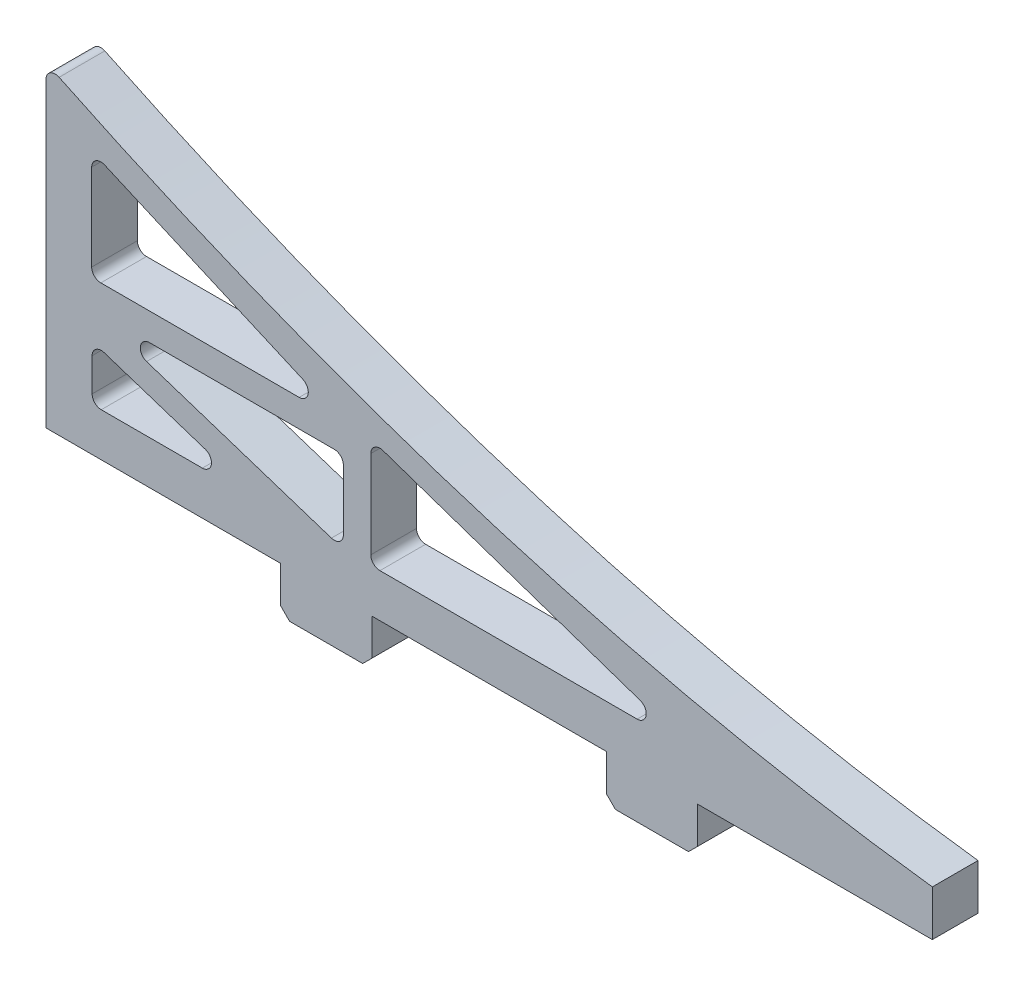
ISO-10303-21;
HEADER;
FILE_DESCRIPTION(('STEP AP214'),'2;1');
FILE_NAME('part.step','',(''),(''),'','','');
FILE_SCHEMA(('AUTOMOTIVE_DESIGN { 1 0 10303 214 1 1 1 1 }'));
ENDSEC;
DATA;
#1=APPLICATION_CONTEXT('core data for automotive mechanical design processes');
#2=APPLICATION_PROTOCOL_DEFINITION('international standard','automotive_design',2000,#1);
#3=PRODUCT_CONTEXT('',#1,'mechanical');
#4=PRODUCT('Part','Part','',(#3));
#5=PRODUCT_RELATED_PRODUCT_CATEGORY('part','',(#4));
#6=PRODUCT_DEFINITION_FORMATION('','',#4);
#7=PRODUCT_DEFINITION_CONTEXT('part definition',#1,'design');
#8=PRODUCT_DEFINITION('design','',#6,#7);
#9=PRODUCT_DEFINITION_SHAPE('','',#8);
#10=(LENGTH_UNIT() NAMED_UNIT(*) SI_UNIT(.MILLI.,.METRE.));
#11=(NAMED_UNIT(*) PLANE_ANGLE_UNIT() SI_UNIT($,.RADIAN.));
#12=(NAMED_UNIT(*) SI_UNIT($,.STERADIAN.) SOLID_ANGLE_UNIT());
#13=UNCERTAINTY_MEASURE_WITH_UNIT(LENGTH_MEASURE(1.E-05),#10,'distance_accuracy_value','');
#14=(GEOMETRIC_REPRESENTATION_CONTEXT(3) GLOBAL_UNCERTAINTY_ASSIGNED_CONTEXT((#13)) GLOBAL_UNIT_ASSIGNED_CONTEXT((#10,
#11,#12)) REPRESENTATION_CONTEXT('',''));
#15=CARTESIAN_POINT('',(0.,0.,0.));
#16=DIRECTION('',(0.,0.,1.));
#17=DIRECTION('',(1.,0.,0.));
#18=AXIS2_PLACEMENT_3D('',#15,#16,#17);
#19=CARTESIAN_POINT('',(-16.66,-2.95812499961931,5.));
#20=DIRECTION('',(0.,1.,0.));
#21=DIRECTION('',(-1.,0.,0.));
#22=AXIS2_PLACEMENT_3D('',#19,#20,#21);
#23=PLANE('',#22);
#24=DIRECTION('',(0.,0.,-1.));
#25=VECTOR('',#24,1.);
#26=CARTESIAN_POINT('',(-52.3399999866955,-2.95812499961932,5.));
#27=LINE('',#26,#25);
#28=CARTESIAN_POINT('',(-52.3399999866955,-2.95812499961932,5.));
#29=VERTEX_POINT('',#28);
#30=CARTESIAN_POINT('',(-52.3399999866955,-2.95812499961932,0.));
#31=VERTEX_POINT('',#30);
#32=EDGE_CURVE('E321',#29,#31,#27,.T.);
#33=ORIENTED_EDGE('',*,*,#32,.F.);
#34=DIRECTION('',(1.,0.,0.));
#35=VECTOR('',#34,1.);
#36=CARTESIAN_POINT('',(-16.66,-2.95812499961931,5.));
#37=LINE('',#36,#35);
#38=CARTESIAN_POINT('',(-77.9999999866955,-2.95812499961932,5.));
#39=VERTEX_POINT('',#38);
#40=EDGE_CURVE('E474',#39,#29,#37,.T.);
#41=ORIENTED_EDGE('',*,*,#40,.F.);
#42=DIRECTION('',(0.,0.,1.));
#43=VECTOR('',#42,1.);
#44=CARTESIAN_POINT('',(-77.9999999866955,-2.95812499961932,5.));
#45=LINE('',#44,#43);
#46=CARTESIAN_POINT('',(-77.9999999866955,-2.95812499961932,0.));
#47=VERTEX_POINT('',#46);
#48=EDGE_CURVE('E340',#47,#39,#45,.T.);
#49=ORIENTED_EDGE('',*,*,#48,.F.);
#50=DIRECTION('',(1.,0.,0.));
#51=VECTOR('',#50,1.);
#52=CARTESIAN_POINT('',(-16.66,-2.95812499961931,0.));
#53=LINE('',#52,#51);
#54=EDGE_CURVE('E313',#47,#31,#53,.T.);
#55=ORIENTED_EDGE('',*,*,#54,.T.);
#56=EDGE_LOOP('',(#33,#41,#49,#55));
#57=FACE_BOUND('',#56,.T.);
#58=ADVANCED_FACE('F35',(#57),#23,.F.);
#59=DIRECTION('',(0.,0.,1.));
#60=VECTOR('',#59,1.);
#61=CARTESIAN_POINT('',(-42.3399999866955,-2.95812499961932,5.));
#62=LINE('',#61,#60);
#63=CARTESIAN_POINT('',(-42.3399999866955,-2.95812499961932,0.));
#64=VERTEX_POINT('',#63);
#65=CARTESIAN_POINT('',(-42.3399999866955,-2.95812499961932,5.));
#66=VERTEX_POINT('',#65);
#67=EDGE_CURVE('E300',#64,#66,#62,.T.);
#68=ORIENTED_EDGE('',*,*,#67,.F.);
#69=CARTESIAN_POINT('',(-16.66,-2.95812499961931,0.));
#70=VERTEX_POINT('',#69);
#71=EDGE_CURVE('E306',#64,#70,#53,.T.);
#72=ORIENTED_EDGE('',*,*,#71,.T.);
#73=DIRECTION('',(0.,0.,-1.));
#74=VECTOR('',#73,1.);
#75=CARTESIAN_POINT('',(-16.66,-2.95812499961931,5.));
#76=LINE('',#75,#74);
#77=CARTESIAN_POINT('',(-16.66,-2.95812499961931,5.));
#78=VERTEX_POINT('',#77);
#79=EDGE_CURVE('E480',#78,#70,#76,.T.);
#80=ORIENTED_EDGE('',*,*,#79,.F.);
#81=EDGE_CURVE('E319',#66,#78,#37,.T.);
#82=ORIENTED_EDGE('',*,*,#81,.F.);
#83=EDGE_LOOP('',(#68,#72,#80,#82));
#84=FACE_BOUND('',#83,.T.);
#85=ADVANCED_FACE('F318',(#84),#23,.F.);
#86=DIRECTION('',(0.,0.,-1.));
#87=VECTOR('',#86,1.);
#88=CARTESIAN_POINT('',(-87.9999999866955,-2.95812499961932,5.));
#89=LINE('',#88,#87);
#90=CARTESIAN_POINT('',(-87.9999999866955,-2.95812499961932,5.));
#91=VERTEX_POINT('',#90);
#92=CARTESIAN_POINT('',(-87.9999999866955,-2.95812499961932,0.));
#93=VERTEX_POINT('',#92);
#94=EDGE_CURVE('E335',#91,#93,#89,.T.);
#95=ORIENTED_EDGE('',*,*,#94,.F.);
#96=CARTESIAN_POINT('',(-113.659999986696,-2.95812499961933,5.));
#97=VERTEX_POINT('',#96);
#98=EDGE_CURVE('E462',#97,#91,#37,.T.);
#99=ORIENTED_EDGE('',*,*,#98,.F.);
#100=DIRECTION('',(0.,0.,-1.));
#101=VECTOR('',#100,1.);
#102=CARTESIAN_POINT('',(-113.659999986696,-2.95812499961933,5.));
#103=LINE('',#102,#101);
#104=CARTESIAN_POINT('',(-113.659999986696,-2.95812499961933,0.));
#105=VERTEX_POINT('',#104);
#106=EDGE_CURVE('E482',#97,#105,#103,.T.);
#107=ORIENTED_EDGE('',*,*,#106,.T.);
#108=EDGE_CURVE('E316',#105,#93,#53,.T.);
#109=ORIENTED_EDGE('',*,*,#108,.T.);
#110=EDGE_LOOP('',(#95,#99,#107,#109));
#111=FACE_BOUND('',#110,.T.);
#112=ADVANCED_FACE('F373',(#111),#23,.F.);
#113=CARTESIAN_POINT('',(-16.6600000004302,2.04187500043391,5.));
#114=CARTESIAN_POINT('',(-65.1599999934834,8.04375000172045,5.));
#115=CARTESIAN_POINT('',(-113.659999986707,31.687499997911,5.));
#116=B_SPLINE_CURVE_WITH_KNOTS('',2,(#113,#114,#115),.UNSPECIFIED.,.F.,.F.,(3,3),
(0.0787227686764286,0.916247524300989),.UNSPECIFIED.);
#117=DIRECTION('',(0.,0.,-1.));
#118=VECTOR('',#117,1.);
#119=SURFACE_OF_LINEAR_EXTRUSION('',#116,#118);
#120=CARTESIAN_POINT('',(-16.6600000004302,2.04187500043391,0.));
#121=CARTESIAN_POINT('',(-65.1599999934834,8.04375000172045,0.));
#122=CARTESIAN_POINT('',(-113.659999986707,31.687499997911,0.));
#123=B_SPLINE_CURVE_WITH_KNOTS('',2,(#120,#121,#122),.UNSPECIFIED.,.F.,.F.,(3,3),
(0.0787227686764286,0.916247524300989),.UNSPECIFIED.);
#124=CARTESIAN_POINT('',(-16.66,2.04187500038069,0.));
#125=VERTEX_POINT('',#124);
#126=CARTESIAN_POINT('',(-112.225716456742,30.9921439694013,0.));
#127=VERTEX_POINT('',#126);
#128=EDGE_CURVE('E355',#125,#127,#123,.T.);
#129=ORIENTED_EDGE('',*,*,#128,.T.);
#130=DIRECTION('',(0.,0.,-1.));
#131=VECTOR('',#130,1.);
#132=CARTESIAN_POINT('',(-112.225716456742,30.9921439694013,0.));
#133=LINE('',#132,#131);
#134=CARTESIAN_POINT('',(-112.225716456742,30.9921439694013,5.));
#135=VERTEX_POINT('',#134);
#136=EDGE_CURVE('E490',#127,#135,#133,.F.);
#137=ORIENTED_EDGE('',*,*,#136,.T.);
#138=CARTESIAN_POINT('',(-16.66,2.04187500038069,5.));
#139=VERTEX_POINT('',#138);
#140=EDGE_CURVE('E356',#139,#135,#116,.T.);
#141=ORIENTED_EDGE('',*,*,#140,.F.);
#142=DIRECTION('',(0.,0.,-1.));
#143=VECTOR('',#142,1.);
#144=CARTESIAN_POINT('',(-16.66,2.04187500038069,5.));
#145=LINE('',#144,#143);
#146=EDGE_CURVE('E475',#139,#125,#145,.T.);
#147=ORIENTED_EDGE('',*,*,#146,.T.);
#148=EDGE_LOOP('',(#129,#137,#141,#147));
#149=FACE_BOUND('',#148,.T.);
#150=ADVANCED_FACE('F368',(#149),#119,.F.);
#151=CARTESIAN_POINT('',(-113.659999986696,31.6874999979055,5.));
#152=DIRECTION('',(1.,0.,0.));
#153=DIRECTION('',(0.,0.,-1.));
#154=AXIS2_PLACEMENT_3D('',#151,#152,#153);
#155=PLANE('',#154);
#156=DIRECTION('',(0.,-1.,0.));
#157=VECTOR('',#156,1.);
#158=CARTESIAN_POINT('',(-113.659999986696,31.6874999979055,5.));
#159=LINE('',#158,#157);
#160=CARTESIAN_POINT('',(-113.659999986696,30.0913677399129,5.));
#161=VERTEX_POINT('',#160);
#162=EDGE_CURVE('E362',#161,#97,#159,.T.);
#163=ORIENTED_EDGE('',*,*,#162,.F.);
#164=DIRECTION('',(0.,0.,-1.));
#165=VECTOR('',#164,1.);
#166=CARTESIAN_POINT('',(-113.659999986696,30.0913677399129,5.));
#167=LINE('',#166,#165);
#168=CARTESIAN_POINT('',(-113.659999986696,30.0913677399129,0.));
#169=VERTEX_POINT('',#168);
#170=EDGE_CURVE('E495',#161,#169,#167,.T.);
#171=ORIENTED_EDGE('',*,*,#170,.T.);
#172=DIRECTION('',(0.,-1.,0.));
#173=VECTOR('',#172,1.);
#174=CARTESIAN_POINT('',(-113.659999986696,31.6874999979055,0.));
#175=LINE('',#174,#173);
#176=EDGE_CURVE('E314',#169,#105,#175,.T.);
#177=ORIENTED_EDGE('',*,*,#176,.T.);
#178=ORIENTED_EDGE('',*,*,#106,.F.);
#179=EDGE_LOOP('',(#163,#171,#177,#178));
#180=FACE_BOUND('',#179,.T.);
#181=ADVANCED_FACE('F372',(#180),#155,.F.);
#182=CARTESIAN_POINT('',(-16.66,2.04187500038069,5.));
#183=DIRECTION('',(-1.,0.,0.));
#184=DIRECTION('',(0.,0.,1.));
#185=AXIS2_PLACEMENT_3D('',#182,#183,#184);
#186=PLANE('',#185);
#187=DIRECTION('',(0.,1.,0.));
#188=VECTOR('',#187,1.);
#189=CARTESIAN_POINT('',(-16.66,2.04187500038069,0.));
#190=LINE('',#189,#188);
#191=EDGE_CURVE('E309',#70,#125,#190,.T.);
#192=ORIENTED_EDGE('',*,*,#191,.T.);
#193=ORIENTED_EDGE('',*,*,#146,.F.);
#194=DIRECTION('',(0.,1.,0.));
#195=VECTOR('',#194,1.);
#196=CARTESIAN_POINT('',(-16.66,2.04187500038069,5.));
#197=LINE('',#196,#195);
#198=EDGE_CURVE('E473',#78,#139,#197,.T.);
#199=ORIENTED_EDGE('',*,*,#198,.F.);
#200=ORIENTED_EDGE('',*,*,#79,.T.);
#201=EDGE_LOOP('',(#192,#193,#199,#200));
#202=FACE_BOUND('',#201,.T.);
#203=ADVANCED_FACE('F484',(#202),#186,.F.);
#204=CARTESIAN_POINT('',(-65.159999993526,12.4542187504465,5.));
#205=DIRECTION('',(0.,0.,-1.));
#206=DIRECTION('',(-1.,0.,0.));
#207=AXIS2_PLACEMENT_3D('',#204,#205,#206);
#208=PLANE('',#207);
#209=DIRECTION('',(0.,-1.,0.));
#210=VECTOR('',#209,1.);
#211=CARTESIAN_POINT('',(-78.1128578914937,13.7911404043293,5.));
#212=LINE('',#211,#210);
#213=CARTESIAN_POINT('',(-78.1128578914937,12.3933814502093,5.));
#214=VERTEX_POINT('',#213);
#215=CARTESIAN_POINT('',(-78.1128578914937,2.79114040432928,5.));
#216=VERTEX_POINT('',#215);
#217=EDGE_CURVE('E667',#214,#216,#212,.T.);
#218=ORIENTED_EDGE('',*,*,#217,.F.);
#219=CARTESIAN_POINT('',(-77.1128578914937,12.3933814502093,5.));
#220=DIRECTION('',(0.,0.,-1.));
#221=DIRECTION('',(-1.,0.,0.));
#222=AXIS2_PLACEMENT_3D('',#219,#220,#221);
#223=CIRCLE('',#222,1.);
#224=CARTESIAN_POINT('',(-76.7899678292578,13.3398179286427,5.));
#225=VERTEX_POINT('',#224);
#226=EDGE_CURVE('E583',#214,#225,#223,.T.);
#227=ORIENTED_EDGE('',*,*,#226,.T.);
#228=DIRECTION('',(-0.946436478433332,0.322890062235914,0.));
#229=VECTOR('',#228,1.);
#230=CARTESIAN_POINT('',(-42.939159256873,1.79114040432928,5.));
#231=LINE('',#230,#229);
#232=CARTESIAN_POINT('',(-48.6444400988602,3.73757688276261,5.));
#233=VERTEX_POINT('',#232);
#234=EDGE_CURVE('E670',#233,#225,#231,.T.);
#235=ORIENTED_EDGE('',*,*,#234,.F.);
#236=CARTESIAN_POINT('',(-48.9673301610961,2.79114040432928,5.));
#237=DIRECTION('',(0.,0.,-1.));
#238=DIRECTION('',(-1.,0.,0.));
#239=AXIS2_PLACEMENT_3D('',#236,#237,#238);
#240=CIRCLE('',#239,1.);
#241=CARTESIAN_POINT('',(-48.9673301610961,1.79114040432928,5.));
#242=VERTEX_POINT('',#241);
#243=EDGE_CURVE('E575',#233,#242,#240,.T.);
#244=ORIENTED_EDGE('',*,*,#243,.T.);
#245=DIRECTION('',(1.,0.,0.));
#246=VECTOR('',#245,1.);
#247=CARTESIAN_POINT('',(-78.1128578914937,1.79114040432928,5.));
#248=LINE('',#247,#246);
#249=CARTESIAN_POINT('',(-77.1128578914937,1.79114040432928,5.));
#250=VERTEX_POINT('',#249);
#251=EDGE_CURVE('E663',#250,#242,#248,.T.);
#252=ORIENTED_EDGE('',*,*,#251,.F.);
#253=CARTESIAN_POINT('',(-77.1128578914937,2.79114040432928,5.));
#254=DIRECTION('',(0.,0.,-1.));
#255=DIRECTION('',(-1.,0.,0.));
#256=AXIS2_PLACEMENT_3D('',#253,#254,#255);
#257=CIRCLE('',#256,1.);
#258=EDGE_CURVE('E579',#250,#216,#257,.T.);
#259=ORIENTED_EDGE('',*,*,#258,.T.);
#260=EDGE_LOOP('',(#218,#227,#235,#244,#252,#259));
#261=FACE_BOUND('',#260,.T.);
#262=DIRECTION('',(0.,1.,0.));
#263=VECTOR('',#262,1.);
#264=CARTESIAN_POINT('',(-81.1128578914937,10.7911404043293,5.));
#265=LINE('',#264,#263);
#266=CARTESIAN_POINT('',(-81.1128578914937,3.17060486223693,5.));
#267=VERTEX_POINT('',#266);
#268=CARTESIAN_POINT('',(-81.1128578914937,9.79114040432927,5.));
#269=VERTEX_POINT('',#268);
#270=EDGE_CURVE('E686',#267,#269,#265,.T.);
#271=ORIENTED_EDGE('',*,*,#270,.F.);
#272=CARTESIAN_POINT('',(-82.1128578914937,3.17060486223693,5.));
#273=DIRECTION('',(0.,0.,-1.));
#274=DIRECTION('',(-1.,0.,0.));
#275=AXIS2_PLACEMENT_3D('',#272,#273,#274);
#276=CIRCLE('',#275,1.);
#277=CARTESIAN_POINT('',(-82.4238969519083,2.22020773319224,5.));
#278=VERTEX_POINT('',#277);
#279=EDGE_CURVE('E591',#267,#278,#276,.T.);
#280=ORIENTED_EDGE('',*,*,#279,.T.);
#281=DIRECTION('',(0.950397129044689,-0.311039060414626,0.));
#282=VECTOR('',#281,1.);
#283=CARTESIAN_POINT('',(-81.1128578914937,1.79114040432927,5.));
#284=LINE('',#283,#282);
#285=CARTESIAN_POINT('',(-102.653311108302,8.84074327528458,5.));
#286=VERTEX_POINT('',#285);
#287=EDGE_CURVE('E689',#286,#278,#284,.T.);
#288=ORIENTED_EDGE('',*,*,#287,.F.);
#289=CARTESIAN_POINT('',(-102.342272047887,9.79114040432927,5.));
#290=DIRECTION('',(0.,0.,-1.));
#291=DIRECTION('',(-1.,0.,0.));
#292=AXIS2_PLACEMENT_3D('',#289,#290,#291);
#293=CIRCLE('',#292,1.);
#294=CARTESIAN_POINT('',(-102.342272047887,10.7911404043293,5.));
#295=VERTEX_POINT('',#294);
#296=EDGE_CURVE('E595',#286,#295,#293,.T.);
#297=ORIENTED_EDGE('',*,*,#296,.T.);
#298=DIRECTION('',(-1.,0.,0.));
#299=VECTOR('',#298,1.);
#300=CARTESIAN_POINT('',(-108.612857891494,10.7911404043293,5.));
#301=LINE('',#300,#299);
#302=CARTESIAN_POINT('',(-82.1128578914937,10.7911404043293,5.));
#303=VERTEX_POINT('',#302);
#304=EDGE_CURVE('E682',#303,#295,#301,.T.);
#305=ORIENTED_EDGE('',*,*,#304,.F.);
#306=CARTESIAN_POINT('',(-82.1128578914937,9.79114040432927,5.));
#307=DIRECTION('',(0.,0.,-1.));
#308=DIRECTION('',(-1.,0.,0.));
#309=AXIS2_PLACEMENT_3D('',#306,#307,#308);
#310=CIRCLE('',#309,1.);
#311=EDGE_CURVE('E587',#303,#269,#310,.T.);
#312=ORIENTED_EDGE('',*,*,#311,.T.);
#313=EDGE_LOOP('',(#271,#280,#288,#297,#305,#312));
#314=FACE_BOUND('',#313,.T.);
#315=DIRECTION('',(0.,-1.,0.));
#316=VECTOR('',#315,1.);
#317=CARTESIAN_POINT('',(-108.612857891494,7.79114040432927,5.));
#318=LINE('',#317,#316);
#319=CARTESIAN_POINT('',(-108.612857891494,6.41167594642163,5.));
#320=VERTEX_POINT('',#319);
#321=CARTESIAN_POINT('',(-108.612857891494,2.79114040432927,5.));
#322=VERTEX_POINT('',#321);
#323=EDGE_CURVE('E704',#320,#322,#318,.T.);
#324=ORIENTED_EDGE('',*,*,#323,.F.);
#325=CARTESIAN_POINT('',(-107.612857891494,6.41167594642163,5.));
#326=DIRECTION('',(0.,0.,-1.));
#327=DIRECTION('',(-1.,0.,0.));
#328=AXIS2_PLACEMENT_3D('',#325,#326,#327);
#329=CIRCLE('',#328,1.);
#330=CARTESIAN_POINT('',(-107.301818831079,7.36207307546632,5.));
#331=VERTEX_POINT('',#330);
#332=EDGE_CURVE('E599',#320,#331,#329,.T.);
#333=ORIENTED_EDGE('',*,*,#332,.T.);
#334=DIRECTION('',(-0.950397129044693,0.311039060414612,0.));
#335=VECTOR('',#334,1.);
#336=CARTESIAN_POINT('',(-90.2795245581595,1.79114040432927,5.));
#337=LINE('',#336,#335);
#338=CARTESIAN_POINT('',(-96.2390713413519,3.74153753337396,5.));
#339=VERTEX_POINT('',#338);
#340=EDGE_CURVE('E676',#339,#331,#337,.T.);
#341=ORIENTED_EDGE('',*,*,#340,.F.);
#342=CARTESIAN_POINT('',(-96.5501104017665,2.79114040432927,5.));
#343=DIRECTION('',(0.,0.,-1.));
#344=DIRECTION('',(-1.,0.,0.));
#345=AXIS2_PLACEMENT_3D('',#342,#343,#344);
#346=CIRCLE('',#345,1.);
#347=CARTESIAN_POINT('',(-96.5501104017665,1.79114040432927,5.));
#348=VERTEX_POINT('',#347);
#349=EDGE_CURVE('E607',#339,#348,#346,.T.);
#350=ORIENTED_EDGE('',*,*,#349,.T.);
#351=DIRECTION('',(1.,0.,0.));
#352=VECTOR('',#351,1.);
#353=CARTESIAN_POINT('',(-108.612857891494,1.79114040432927,5.));
#354=LINE('',#353,#352);
#355=CARTESIAN_POINT('',(-107.612857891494,1.79114040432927,5.));
#356=VERTEX_POINT('',#355);
#357=EDGE_CURVE('E700',#356,#348,#354,.T.);
#358=ORIENTED_EDGE('',*,*,#357,.F.);
#359=CARTESIAN_POINT('',(-107.612857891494,2.79114040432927,5.));
#360=DIRECTION('',(0.,0.,-1.));
#361=DIRECTION('',(-1.,0.,0.));
#362=AXIS2_PLACEMENT_3D('',#359,#360,#361);
#363=CIRCLE('',#362,1.);
#364=EDGE_CURVE('E603',#356,#322,#363,.T.);
#365=ORIENTED_EDGE('',*,*,#364,.T.);
#366=EDGE_LOOP('',(#324,#333,#341,#350,#358,#365));
#367=FACE_BOUND('',#366,.T.);
#368=DIRECTION('',(0.,-1.,0.));
#369=VECTOR('',#368,1.);
#370=CARTESIAN_POINT('',(-108.659999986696,25.7911404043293,5.));
#371=LINE('',#370,#369);
#372=CARTESIAN_POINT('',(-108.659999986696,24.2636151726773,5.));
#373=VERTEX_POINT('',#372);
#374=CARTESIAN_POINT('',(-108.659999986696,14.7911404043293,5.));
#375=VERTEX_POINT('',#374);
#376=EDGE_CURVE('E650',#373,#375,#371,.T.);
#377=ORIENTED_EDGE('',*,*,#376,.F.);
#378=CARTESIAN_POINT('',(-107.659999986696,24.2636151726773,5.));
#379=DIRECTION('',(0.,0.,-1.));
#380=DIRECTION('',(-1.,0.,0.));
#381=AXIS2_PLACEMENT_3D('',#378,#379,#380);
#382=CIRCLE('',#381,1.);
#383=CARTESIAN_POINT('',(-107.259999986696,25.1801303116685,5.));
#384=VERTEX_POINT('',#383);
#385=EDGE_CURVE('E526',#373,#384,#382,.T.);
#386=ORIENTED_EDGE('',*,*,#385,.T.);
#387=DIRECTION('',(-0.916515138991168,0.4,0.));
#388=VECTOR('',#387,1.);
#389=CARTESIAN_POINT('',(-81.1645458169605,13.7911404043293,5.));
#390=LINE('',#389,#388);
#391=CARTESIAN_POINT('',(-85.5558336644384,15.7076555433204,5.));
#392=VERTEX_POINT('',#391);
#393=EDGE_CURVE('E653',#392,#384,#390,.T.);
#394=ORIENTED_EDGE('',*,*,#393,.F.);
#395=CARTESIAN_POINT('',(-85.9558336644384,14.7911404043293,5.));
#396=DIRECTION('',(0.,0.,-1.));
#397=DIRECTION('',(-1.,0.,0.));
#398=AXIS2_PLACEMENT_3D('',#395,#396,#397);
#399=CIRCLE('',#398,1.);
#400=CARTESIAN_POINT('',(-85.9558336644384,13.7911404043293,5.));
#401=VERTEX_POINT('',#400);
#402=EDGE_CURVE('E507',#392,#401,#399,.T.);
#403=ORIENTED_EDGE('',*,*,#402,.T.);
#404=DIRECTION('',(1.,0.,0.));
#405=VECTOR('',#404,1.);
#406=CARTESIAN_POINT('',(-108.659999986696,13.7911404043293,5.));
#407=LINE('',#406,#405);
#408=CARTESIAN_POINT('',(-107.659999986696,13.7911404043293,5.));
#409=VERTEX_POINT('',#408);
#410=EDGE_CURVE('E647',#409,#401,#407,.T.);
#411=ORIENTED_EDGE('',*,*,#410,.F.);
#412=CARTESIAN_POINT('',(-107.659999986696,14.7911404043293,5.));
#413=DIRECTION('',(0.,0.,-1.));
#414=DIRECTION('',(-1.,0.,0.));
#415=AXIS2_PLACEMENT_3D('',#412,#413,#414);
#416=CIRCLE('',#415,1.);
#417=EDGE_CURVE('E522',#409,#375,#416,.T.);
#418=ORIENTED_EDGE('',*,*,#417,.T.);
#419=EDGE_LOOP('',(#377,#386,#394,#403,#411,#418));
#420=FACE_BOUND('',#419,.T.);
#421=DIRECTION('',(-1.,0.,0.));
#422=VECTOR('',#421,1.);
#423=CARTESIAN_POINT('',(-52.3399999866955,-7.95812499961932,5.));
#424=LINE('',#423,#422);
#425=CARTESIAN_POINT('',(-43.3399999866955,-7.95812499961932,5.));
#426=VERTEX_POINT('',#425);
#427=CARTESIAN_POINT('',(-51.3399999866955,-7.95812499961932,5.));
#428=VERTEX_POINT('',#427);
#429=EDGE_CURVE('E324',#426,#428,#424,.T.);
#430=ORIENTED_EDGE('',*,*,#429,.F.);
#431=DIRECTION('',(0.70710678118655,0.707106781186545,0.));
#432=VECTOR('',#431,1.);
#433=CARTESIAN_POINT('',(-43.3399999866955,-7.95812499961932,5.));
#434=LINE('',#433,#432);
#435=CARTESIAN_POINT('',(-42.3399999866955,-6.9581249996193,5.));
#436=VERTEX_POINT('',#435);
#437=EDGE_CURVE('E637',#426,#436,#434,.T.);
#438=ORIENTED_EDGE('',*,*,#437,.T.);
#439=DIRECTION('',(0.,1.,0.));
#440=VECTOR('',#439,1.);
#441=CARTESIAN_POINT('',(-42.3399999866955,-7.95812499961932,5.));
#442=LINE('',#441,#440);
#443=EDGE_CURVE('E303',#436,#66,#442,.T.);
#444=ORIENTED_EDGE('',*,*,#443,.T.);
#445=ORIENTED_EDGE('',*,*,#81,.T.);
#446=ORIENTED_EDGE('',*,*,#198,.T.);
#447=ORIENTED_EDGE('',*,*,#140,.T.);
#448=CARTESIAN_POINT('',(-112.659999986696,30.0913677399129,5.));
#449=DIRECTION('',(0.,0.,-1.));
#450=DIRECTION('',(-1.,0.,0.));
#451=AXIS2_PLACEMENT_3D('',#448,#449,#450);
#452=CIRCLE('',#451,1.);
#453=EDGE_CURVE('E492',#135,#161,#452,.F.);
#454=ORIENTED_EDGE('',*,*,#453,.T.);
#455=ORIENTED_EDGE('',*,*,#162,.T.);
#456=ORIENTED_EDGE('',*,*,#98,.T.);
#457=DIRECTION('',(0.,1.,0.));
#458=VECTOR('',#457,1.);
#459=CARTESIAN_POINT('',(-87.9999999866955,-7.95812499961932,5.));
#460=LINE('',#459,#458);
#461=CARTESIAN_POINT('',(-87.9999999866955,-6.95812499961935,5.));
#462=VERTEX_POINT('',#461);
#463=EDGE_CURVE('E343',#462,#91,#460,.T.);
#464=ORIENTED_EDGE('',*,*,#463,.F.);
#465=DIRECTION('',(0.707106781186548,-0.707106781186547,0.));
#466=VECTOR('',#465,1.);
#467=CARTESIAN_POINT('',(-86.9999999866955,-7.95812499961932,5.));
#468=LINE('',#467,#466);
#469=CARTESIAN_POINT('',(-86.9999999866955,-7.95812499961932,5.));
#470=VERTEX_POINT('',#469);
#471=EDGE_CURVE('E617',#462,#470,#468,.T.);
#472=ORIENTED_EDGE('',*,*,#471,.T.);
#473=DIRECTION('',(-1.,0.,0.));
#474=VECTOR('',#473,1.);
#475=CARTESIAN_POINT('',(-87.9999999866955,-7.95812499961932,5.));
#476=LINE('',#475,#474);
#477=CARTESIAN_POINT('',(-78.9999999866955,-7.95812499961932,5.));
#478=VERTEX_POINT('',#477);
#479=EDGE_CURVE('E339',#478,#470,#476,.T.);
#480=ORIENTED_EDGE('',*,*,#479,.F.);
#481=DIRECTION('',(0.707106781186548,0.707106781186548,0.));
#482=VECTOR('',#481,1.);
#483=CARTESIAN_POINT('',(-78.9999999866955,-7.95812499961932,5.));
#484=LINE('',#483,#482);
#485=CARTESIAN_POINT('',(-77.9999999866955,-6.95812499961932,5.));
#486=VERTEX_POINT('',#485);
#487=EDGE_CURVE('E619',#478,#486,#484,.T.);
#488=ORIENTED_EDGE('',*,*,#487,.T.);
#489=DIRECTION('',(0.,1.,0.));
#490=VECTOR('',#489,1.);
#491=CARTESIAN_POINT('',(-77.9999999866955,-7.95812499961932,5.));
#492=LINE('',#491,#490);
#493=EDGE_CURVE('E349',#486,#39,#492,.T.);
#494=ORIENTED_EDGE('',*,*,#493,.T.);
#495=ORIENTED_EDGE('',*,*,#40,.T.);
#496=DIRECTION('',(0.,1.,0.));
#497=VECTOR('',#496,1.);
#498=CARTESIAN_POINT('',(-52.3399999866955,-7.95812499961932,5.));
#499=LINE('',#498,#497);
#500=CARTESIAN_POINT('',(-52.3399999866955,-6.9581249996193,5.));
#501=VERTEX_POINT('',#500);
#502=EDGE_CURVE('E331',#501,#29,#499,.T.);
#503=ORIENTED_EDGE('',*,*,#502,.F.);
#504=DIRECTION('',(0.707106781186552,-0.707106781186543,0.));
#505=VECTOR('',#504,1.);
#506=CARTESIAN_POINT('',(-51.3399999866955,-7.95812499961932,5.));
#507=LINE('',#506,#505);
#508=EDGE_CURVE('E635',#501,#428,#507,.T.);
#509=ORIENTED_EDGE('',*,*,#508,.T.);
#510=EDGE_LOOP('',(#430,#438,#444,#445,#446,#447,#454,#455,#456,#464,#472,#480,#488,#494,#495,
#503,#509));
#511=FACE_BOUND('',#510,.T.);
#512=ADVANCED_FACE('F469',(#261,#314,#367,#420,#511),#208,.F.);
#513=CARTESIAN_POINT('',(-65.159999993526,12.4542187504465,0.));
#514=DIRECTION('',(0.,0.,-1.));
#515=DIRECTION('',(-1.,0.,0.));
#516=AXIS2_PLACEMENT_3D('',#513,#514,#515);
#517=PLANE('',#516);
#518=DIRECTION('',(1.,0.,0.));
#519=VECTOR('',#518,1.);
#520=CARTESIAN_POINT('',(-78.1128578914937,1.79114040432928,0.));
#521=LINE('',#520,#519);
#522=CARTESIAN_POINT('',(-77.1128578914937,1.79114040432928,0.));
#523=VERTEX_POINT('',#522);
#524=CARTESIAN_POINT('',(-48.9673301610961,1.79114040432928,0.));
#525=VERTEX_POINT('',#524);
#526=EDGE_CURVE('E673',#523,#525,#521,.T.);
#527=ORIENTED_EDGE('',*,*,#526,.T.);
#528=CARTESIAN_POINT('',(-48.9673301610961,2.79114040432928,0.));
#529=DIRECTION('',(0.,0.,-1.));
#530=DIRECTION('',(-1.,0.,0.));
#531=AXIS2_PLACEMENT_3D('',#528,#529,#530);
#532=CIRCLE('',#531,1.);
#533=CARTESIAN_POINT('',(-48.6444400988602,3.73757688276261,0.));
#534=VERTEX_POINT('',#533);
#535=EDGE_CURVE('E577',#525,#534,#532,.F.);
#536=ORIENTED_EDGE('',*,*,#535,.T.);
#537=DIRECTION('',(-0.946436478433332,0.322890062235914,0.));
#538=VECTOR('',#537,1.);
#539=CARTESIAN_POINT('',(-42.939159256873,1.79114040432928,0.));
#540=LINE('',#539,#538);
#541=CARTESIAN_POINT('',(-76.7899678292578,13.3398179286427,0.));
#542=VERTEX_POINT('',#541);
#543=EDGE_CURVE('E666',#534,#542,#540,.T.);
#544=ORIENTED_EDGE('',*,*,#543,.T.);
#545=CARTESIAN_POINT('',(-77.1128578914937,12.3933814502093,0.));
#546=DIRECTION('',(0.,0.,-1.));
#547=DIRECTION('',(-1.,0.,0.));
#548=AXIS2_PLACEMENT_3D('',#545,#546,#547);
#549=CIRCLE('',#548,1.);
#550=CARTESIAN_POINT('',(-78.1128578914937,12.3933814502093,0.));
#551=VERTEX_POINT('',#550);
#552=EDGE_CURVE('E585',#542,#551,#549,.F.);
#553=ORIENTED_EDGE('',*,*,#552,.T.);
#554=DIRECTION('',(0.,-1.,0.));
#555=VECTOR('',#554,1.);
#556=CARTESIAN_POINT('',(-78.1128578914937,13.7911404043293,0.));
#557=LINE('',#556,#555);
#558=CARTESIAN_POINT('',(-78.1128578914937,2.79114040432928,0.));
#559=VERTEX_POINT('',#558);
#560=EDGE_CURVE('E677',#551,#559,#557,.T.);
#561=ORIENTED_EDGE('',*,*,#560,.T.);
#562=CARTESIAN_POINT('',(-77.1128578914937,2.79114040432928,0.));
#563=DIRECTION('',(0.,0.,-1.));
#564=DIRECTION('',(-1.,0.,0.));
#565=AXIS2_PLACEMENT_3D('',#562,#563,#564);
#566=CIRCLE('',#565,1.);
#567=EDGE_CURVE('E581',#559,#523,#566,.F.);
#568=ORIENTED_EDGE('',*,*,#567,.T.);
#569=EDGE_LOOP('',(#527,#536,#544,#553,#561,#568));
#570=FACE_BOUND('',#569,.T.);
#571=DIRECTION('',(-1.,0.,0.));
#572=VECTOR('',#571,1.);
#573=CARTESIAN_POINT('',(-108.612857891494,10.7911404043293,0.));
#574=LINE('',#573,#572);
#575=CARTESIAN_POINT('',(-82.1128578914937,10.7911404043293,0.));
#576=VERTEX_POINT('',#575);
#577=CARTESIAN_POINT('',(-102.342272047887,10.7911404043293,0.));
#578=VERTEX_POINT('',#577);
#579=EDGE_CURVE('E656',#576,#578,#574,.T.);
#580=ORIENTED_EDGE('',*,*,#579,.T.);
#581=CARTESIAN_POINT('',(-102.342272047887,9.79114040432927,0.));
#582=DIRECTION('',(0.,0.,-1.));
#583=DIRECTION('',(-1.,0.,0.));
#584=AXIS2_PLACEMENT_3D('',#581,#582,#583);
#585=CIRCLE('',#584,1.);
#586=CARTESIAN_POINT('',(-102.653311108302,8.84074327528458,0.));
#587=VERTEX_POINT('',#586);
#588=EDGE_CURVE('E597',#578,#587,#585,.F.);
#589=ORIENTED_EDGE('',*,*,#588,.T.);
#590=DIRECTION('',(0.950397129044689,-0.311039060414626,0.));
#591=VECTOR('',#590,1.);
#592=CARTESIAN_POINT('',(-81.1128578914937,1.79114040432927,0.));
#593=LINE('',#592,#591);
#594=CARTESIAN_POINT('',(-82.4238969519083,2.22020773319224,0.));
#595=VERTEX_POINT('',#594);
#596=EDGE_CURVE('E685',#587,#595,#593,.T.);
#597=ORIENTED_EDGE('',*,*,#596,.T.);
#598=CARTESIAN_POINT('',(-82.1128578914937,3.17060486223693,0.));
#599=DIRECTION('',(0.,0.,-1.));
#600=DIRECTION('',(-1.,0.,0.));
#601=AXIS2_PLACEMENT_3D('',#598,#599,#600);
#602=CIRCLE('',#601,1.);
#603=CARTESIAN_POINT('',(-81.1128578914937,3.17060486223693,0.));
#604=VERTEX_POINT('',#603);
#605=EDGE_CURVE('E593',#595,#604,#602,.F.);
#606=ORIENTED_EDGE('',*,*,#605,.T.);
#607=DIRECTION('',(0.,1.,0.));
#608=VECTOR('',#607,1.);
#609=CARTESIAN_POINT('',(-81.1128578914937,10.7911404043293,0.));
#610=LINE('',#609,#608);
#611=CARTESIAN_POINT('',(-81.1128578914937,9.79114040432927,0.));
#612=VERTEX_POINT('',#611);
#613=EDGE_CURVE('E695',#604,#612,#610,.T.);
#614=ORIENTED_EDGE('',*,*,#613,.T.);
#615=CARTESIAN_POINT('',(-82.1128578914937,9.79114040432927,0.));
#616=DIRECTION('',(0.,0.,-1.));
#617=DIRECTION('',(-1.,0.,0.));
#618=AXIS2_PLACEMENT_3D('',#615,#616,#617);
#619=CIRCLE('',#618,1.);
#620=EDGE_CURVE('E589',#612,#576,#619,.F.);
#621=ORIENTED_EDGE('',*,*,#620,.T.);
#622=EDGE_LOOP('',(#580,#589,#597,#606,#614,#621));
#623=FACE_BOUND('',#622,.T.);
#624=DIRECTION('',(1.,0.,0.));
#625=VECTOR('',#624,1.);
#626=CARTESIAN_POINT('',(-108.612857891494,1.79114040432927,0.));
#627=LINE('',#626,#625);
#628=CARTESIAN_POINT('',(-107.612857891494,1.79114040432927,0.));
#629=VERTEX_POINT('',#628);
#630=CARTESIAN_POINT('',(-96.5501104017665,1.79114040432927,0.));
#631=VERTEX_POINT('',#630);
#632=EDGE_CURVE('E692',#629,#631,#627,.T.);
#633=ORIENTED_EDGE('',*,*,#632,.T.);
#634=CARTESIAN_POINT('',(-96.5501104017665,2.79114040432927,0.));
#635=DIRECTION('',(0.,0.,-1.));
#636=DIRECTION('',(-1.,0.,0.));
#637=AXIS2_PLACEMENT_3D('',#634,#635,#636);
#638=CIRCLE('',#637,1.);
#639=CARTESIAN_POINT('',(-96.2390713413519,3.74153753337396,0.));
#640=VERTEX_POINT('',#639);
#641=EDGE_CURVE('E609',#631,#640,#638,.F.);
#642=ORIENTED_EDGE('',*,*,#641,.T.);
#643=DIRECTION('',(-0.950397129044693,0.311039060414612,0.));
#644=VECTOR('',#643,1.);
#645=CARTESIAN_POINT('',(-90.2795245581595,1.79114040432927,0.));
#646=LINE('',#645,#644);
#647=CARTESIAN_POINT('',(-107.301818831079,7.36207307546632,0.));
#648=VERTEX_POINT('',#647);
#649=EDGE_CURVE('E703',#640,#648,#646,.T.);
#650=ORIENTED_EDGE('',*,*,#649,.T.);
#651=CARTESIAN_POINT('',(-107.612857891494,6.41167594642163,0.));
#652=DIRECTION('',(0.,0.,-1.));
#653=DIRECTION('',(-1.,0.,0.));
#654=AXIS2_PLACEMENT_3D('',#651,#652,#653);
#655=CIRCLE('',#654,1.);
#656=CARTESIAN_POINT('',(-108.612857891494,6.41167594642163,0.));
#657=VERTEX_POINT('',#656);
#658=EDGE_CURVE('E601',#648,#657,#655,.F.);
#659=ORIENTED_EDGE('',*,*,#658,.T.);
#660=DIRECTION('',(0.,-1.,0.));
#661=VECTOR('',#660,1.);
#662=CARTESIAN_POINT('',(-108.612857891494,7.79114040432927,0.));
#663=LINE('',#662,#661);
#664=CARTESIAN_POINT('',(-108.612857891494,2.79114040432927,0.));
#665=VERTEX_POINT('',#664);
#666=EDGE_CURVE('E711',#657,#665,#663,.T.);
#667=ORIENTED_EDGE('',*,*,#666,.T.);
#668=CARTESIAN_POINT('',(-107.612857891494,2.79114040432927,0.));
#669=DIRECTION('',(0.,0.,-1.));
#670=DIRECTION('',(-1.,0.,0.));
#671=AXIS2_PLACEMENT_3D('',#668,#669,#670);
#672=CIRCLE('',#671,1.);
#673=EDGE_CURVE('E605',#665,#629,#672,.F.);
#674=ORIENTED_EDGE('',*,*,#673,.T.);
#675=EDGE_LOOP('',(#633,#642,#650,#659,#667,#674));
#676=FACE_BOUND('',#675,.T.);
#677=DIRECTION('',(0.,-1.,0.));
#678=VECTOR('',#677,1.);
#679=CARTESIAN_POINT('',(-108.659999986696,25.7911404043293,0.));
#680=LINE('',#679,#678);
#681=CARTESIAN_POINT('',(-108.659999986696,24.2636151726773,0.));
#682=VERTEX_POINT('',#681);
#683=CARTESIAN_POINT('',(-108.659999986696,14.7911404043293,0.));
#684=VERTEX_POINT('',#683);
#685=EDGE_CURVE('E658',#682,#684,#680,.T.);
#686=ORIENTED_EDGE('',*,*,#685,.T.);
#687=CARTESIAN_POINT('',(-107.659999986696,14.7911404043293,0.));
#688=DIRECTION('',(0.,0.,-1.));
#689=DIRECTION('',(-1.,0.,0.));
#690=AXIS2_PLACEMENT_3D('',#687,#688,#689);
#691=CIRCLE('',#690,1.);
#692=CARTESIAN_POINT('',(-107.659999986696,13.7911404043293,0.));
#693=VERTEX_POINT('',#692);
#694=EDGE_CURVE('E524',#684,#693,#691,.F.);
#695=ORIENTED_EDGE('',*,*,#694,.T.);
#696=DIRECTION('',(1.,0.,0.));
#697=VECTOR('',#696,1.);
#698=CARTESIAN_POINT('',(-108.659999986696,13.7911404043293,0.));
#699=LINE('',#698,#697);
#700=CARTESIAN_POINT('',(-85.9558336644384,13.7911404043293,0.));
#701=VERTEX_POINT('',#700);
#702=EDGE_CURVE('E327',#693,#701,#699,.T.);
#703=ORIENTED_EDGE('',*,*,#702,.T.);
#704=CARTESIAN_POINT('',(-85.9558336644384,14.7911404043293,0.));
#705=DIRECTION('',(0.,0.,-1.));
#706=DIRECTION('',(-1.,0.,0.));
#707=AXIS2_PLACEMENT_3D('',#704,#705,#706);
#708=CIRCLE('',#707,1.);
#709=CARTESIAN_POINT('',(-85.5558336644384,15.7076555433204,0.));
#710=VERTEX_POINT('',#709);
#711=EDGE_CURVE('E510',#701,#710,#708,.F.);
#712=ORIENTED_EDGE('',*,*,#711,.T.);
#713=DIRECTION('',(-0.916515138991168,0.4,0.));
#714=VECTOR('',#713,1.);
#715=CARTESIAN_POINT('',(-81.1645458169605,13.7911404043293,0.));
#716=LINE('',#715,#714);
#717=CARTESIAN_POINT('',(-107.259999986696,25.1801303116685,0.));
#718=VERTEX_POINT('',#717);
#719=EDGE_CURVE('E649',#710,#718,#716,.T.);
#720=ORIENTED_EDGE('',*,*,#719,.T.);
#721=CARTESIAN_POINT('',(-107.659999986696,24.2636151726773,0.));
#722=DIRECTION('',(0.,0.,-1.));
#723=DIRECTION('',(-1.,0.,0.));
#724=AXIS2_PLACEMENT_3D('',#721,#722,#723);
#725=CIRCLE('',#724,1.);
#726=EDGE_CURVE('E528',#718,#682,#725,.F.);
#727=ORIENTED_EDGE('',*,*,#726,.T.);
#728=EDGE_LOOP('',(#686,#695,#703,#712,#720,#727));
#729=FACE_BOUND('',#728,.T.);
#730=DIRECTION('',(0.,1.,0.));
#731=VECTOR('',#730,1.);
#732=CARTESIAN_POINT('',(-42.3399999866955,-7.95812499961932,0.));
#733=LINE('',#732,#731);
#734=CARTESIAN_POINT('',(-42.3399999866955,-6.9581249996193,0.));
#735=VERTEX_POINT('',#734);
#736=EDGE_CURVE('E296',#735,#64,#733,.T.);
#737=ORIENTED_EDGE('',*,*,#736,.F.);
#738=DIRECTION('',(-0.70710678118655,-0.707106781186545,0.));
#739=VECTOR('',#738,1.);
#740=CARTESIAN_POINT('',(-44.043828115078,-8.66195312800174,0.));
#741=LINE('',#740,#739);
#742=CARTESIAN_POINT('',(-43.3399999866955,-7.95812499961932,0.));
#743=VERTEX_POINT('',#742);
#744=EDGE_CURVE('E43',#735,#743,#741,.T.);
#745=ORIENTED_EDGE('',*,*,#744,.T.);
#746=DIRECTION('',(1.,0.,0.));
#747=VECTOR('',#746,1.);
#748=CARTESIAN_POINT('',(-52.3399999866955,-7.95812499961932,0.));
#749=LINE('',#748,#747);
#750=CARTESIAN_POINT('',(-51.3399999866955,-7.95812499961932,0.));
#751=VERTEX_POINT('',#750);
#752=EDGE_CURVE('E320',#751,#743,#749,.T.);
#753=ORIENTED_EDGE('',*,*,#752,.F.);
#754=DIRECTION('',(-0.707106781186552,0.707106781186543,0.));
#755=VECTOR('',#754,1.);
#756=CARTESIAN_POINT('',(-68.4561718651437,9.15804687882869,0.));
#757=LINE('',#756,#755);
#758=CARTESIAN_POINT('',(-52.3399999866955,-6.9581249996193,0.));
#759=VERTEX_POINT('',#758);
#760=EDGE_CURVE('E50',#751,#759,#757,.T.);
#761=ORIENTED_EDGE('',*,*,#760,.T.);
#762=DIRECTION('',(0.,1.,0.));
#763=VECTOR('',#762,1.);
#764=CARTESIAN_POINT('',(-52.3399999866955,-7.95812499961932,0.));
#765=LINE('',#764,#763);
#766=EDGE_CURVE('E302',#759,#31,#765,.T.);
#767=ORIENTED_EDGE('',*,*,#766,.T.);
#768=ORIENTED_EDGE('',*,*,#54,.F.);
#769=DIRECTION('',(0.,1.,0.));
#770=VECTOR('',#769,1.);
#771=CARTESIAN_POINT('',(-77.9999999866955,-7.95812499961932,0.));
#772=LINE('',#771,#770);
#773=CARTESIAN_POINT('',(-77.9999999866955,-6.95812499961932,0.));
#774=VERTEX_POINT('',#773);
#775=EDGE_CURVE('E351',#774,#47,#772,.T.);
#776=ORIENTED_EDGE('',*,*,#775,.F.);
#777=DIRECTION('',(-0.707106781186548,-0.707106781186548,0.));
#778=VECTOR('',#777,1.);
#779=CARTESIAN_POINT('',(-61.8738281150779,9.16804687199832,0.));
#780=LINE('',#779,#778);
#781=CARTESIAN_POINT('',(-78.9999999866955,-7.95812499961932,0.));
#782=VERTEX_POINT('',#781);
#783=EDGE_CURVE('E625',#774,#782,#780,.T.);
#784=ORIENTED_EDGE('',*,*,#783,.T.);
#785=DIRECTION('',(1.,0.,0.));
#786=VECTOR('',#785,1.);
#787=CARTESIAN_POINT('',(-87.9999999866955,-7.95812499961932,0.));
#788=LINE('',#787,#786);
#789=CARTESIAN_POINT('',(-86.9999999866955,-7.95812499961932,0.));
#790=VERTEX_POINT('',#789);
#791=EDGE_CURVE('E336',#790,#782,#788,.T.);
#792=ORIENTED_EDGE('',*,*,#791,.F.);
#793=DIRECTION('',(-0.707106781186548,0.707106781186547,0.));
#794=VECTOR('',#793,1.);
#795=CARTESIAN_POINT('',(-86.2861718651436,-8.6719531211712,0.));
#796=LINE('',#795,#794);
#797=CARTESIAN_POINT('',(-87.9999999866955,-6.95812499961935,0.));
#798=VERTEX_POINT('',#797);
#799=EDGE_CURVE('E623',#790,#798,#796,.T.);
#800=ORIENTED_EDGE('',*,*,#799,.T.);
#801=DIRECTION('',(0.,1.,0.));
#802=VECTOR('',#801,1.);
#803=CARTESIAN_POINT('',(-87.9999999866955,-7.95812499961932,0.));
#804=LINE('',#803,#802);
#805=EDGE_CURVE('E353',#798,#93,#804,.T.);
#806=ORIENTED_EDGE('',*,*,#805,.T.);
#807=ORIENTED_EDGE('',*,*,#108,.F.);
#808=ORIENTED_EDGE('',*,*,#176,.F.);
#809=CARTESIAN_POINT('',(-112.659999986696,30.0913677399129,0.));
#810=DIRECTION('',(0.,0.,-1.));
#811=DIRECTION('',(-1.,0.,0.));
#812=AXIS2_PLACEMENT_3D('',#809,#810,#811);
#813=CIRCLE('',#812,1.);
#814=EDGE_CURVE('E501',#169,#127,#813,.T.);
#815=ORIENTED_EDGE('',*,*,#814,.T.);
#816=ORIENTED_EDGE('',*,*,#128,.F.);
#817=ORIENTED_EDGE('',*,*,#191,.F.);
#818=ORIENTED_EDGE('',*,*,#71,.F.);
#819=EDGE_LOOP('',(#737,#745,#753,#761,#767,#768,#776,#784,#792,#800,#806,#807,#808,#815,#816,
#817,#818));
#820=FACE_BOUND('',#819,.T.);
#821=ADVANCED_FACE('F307',(#570,#623,#676,#729,#820),#517,.T.);
#822=CARTESIAN_POINT('',(-87.9999999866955,-7.95812499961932,5.));
#823=DIRECTION('',(1.,0.,0.));
#824=DIRECTION('',(0.,1.,0.));
#825=AXIS2_PLACEMENT_3D('',#822,#823,#824);
#826=PLANE('',#825);
#827=ORIENTED_EDGE('',*,*,#805,.F.);
#828=DIRECTION('',(0.,0.,1.));
#829=VECTOR('',#828,1.);
#830=CARTESIAN_POINT('',(-87.9999999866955,-6.95812499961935,5.));
#831=LINE('',#830,#829);
#832=EDGE_CURVE('E627',#798,#462,#831,.T.);
#833=ORIENTED_EDGE('',*,*,#832,.T.);
#834=ORIENTED_EDGE('',*,*,#463,.T.);
#835=ORIENTED_EDGE('',*,*,#94,.T.);
#836=EDGE_LOOP('',(#827,#833,#834,#835));
#837=FACE_BOUND('',#836,.T.);
#838=ADVANCED_FACE('F797',(#837),#826,.F.);
#839=CARTESIAN_POINT('',(-77.9999999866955,-7.95812499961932,5.));
#840=DIRECTION('',(-1.,0.,0.));
#841=DIRECTION('',(0.,-1.,0.));
#842=AXIS2_PLACEMENT_3D('',#839,#840,#841);
#843=PLANE('',#842);
#844=ORIENTED_EDGE('',*,*,#493,.F.);
#845=DIRECTION('',(0.,0.,-1.));
#846=VECTOR('',#845,1.);
#847=CARTESIAN_POINT('',(-77.9999999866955,-6.95812499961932,0.));
#848=LINE('',#847,#846);
#849=EDGE_CURVE('E621',#486,#774,#848,.T.);
#850=ORIENTED_EDGE('',*,*,#849,.T.);
#851=ORIENTED_EDGE('',*,*,#775,.T.);
#852=ORIENTED_EDGE('',*,*,#48,.T.);
#853=EDGE_LOOP('',(#844,#850,#851,#852));
#854=FACE_BOUND('',#853,.T.);
#855=ADVANCED_FACE('F793',(#854),#843,.F.);
#856=CARTESIAN_POINT('',(0.,-7.95812499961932,0.));
#857=DIRECTION('',(0.,-1.,0.));
#858=DIRECTION('',(1.,0.,0.));
#859=AXIS2_PLACEMENT_3D('',#856,#857,#858);
#860=PLANE('',#859);
#861=ORIENTED_EDGE('',*,*,#791,.T.);
#862=DIRECTION('',(0.,0.,1.));
#863=VECTOR('',#862,1.);
#864=CARTESIAN_POINT('',(-78.9999999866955,-7.95812499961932,5.));
#865=LINE('',#864,#863);
#866=EDGE_CURVE('E614',#782,#478,#865,.T.);
#867=ORIENTED_EDGE('',*,*,#866,.T.);
#868=ORIENTED_EDGE('',*,*,#479,.T.);
#869=DIRECTION('',(0.,0.,-1.));
#870=VECTOR('',#869,1.);
#871=CARTESIAN_POINT('',(-86.9999999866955,-7.95812499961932,0.));
#872=LINE('',#871,#870);
#873=EDGE_CURVE('E611',#470,#790,#872,.T.);
#874=ORIENTED_EDGE('',*,*,#873,.T.);
#875=EDGE_LOOP('',(#861,#867,#868,#874));
#876=FACE_BOUND('',#875,.T.);
#877=ADVANCED_FACE('F789',(#876),#860,.T.);
#878=CARTESIAN_POINT('',(-52.3399999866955,-7.95812499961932,5.));
#879=DIRECTION('',(1.,0.,0.));
#880=DIRECTION('',(0.,1.,0.));
#881=AXIS2_PLACEMENT_3D('',#878,#879,#880);
#882=PLANE('',#881);
#883=ORIENTED_EDGE('',*,*,#766,.F.);
#884=DIRECTION('',(0.,0.,1.));
#885=VECTOR('',#884,1.);
#886=CARTESIAN_POINT('',(-52.3399999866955,-6.9581249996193,5.));
#887=LINE('',#886,#885);
#888=EDGE_CURVE('E11',#759,#501,#887,.T.);
#889=ORIENTED_EDGE('',*,*,#888,.T.);
#890=ORIENTED_EDGE('',*,*,#502,.T.);
#891=ORIENTED_EDGE('',*,*,#32,.T.);
#892=EDGE_LOOP('',(#883,#889,#890,#891));
#893=FACE_BOUND('',#892,.T.);
#894=ADVANCED_FACE('F786',(#893),#882,.F.);
#895=CARTESIAN_POINT('',(-42.3399999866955,-7.95812499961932,5.));
#896=DIRECTION('',(-1.,0.,0.));
#897=DIRECTION('',(0.,0.,1.));
#898=AXIS2_PLACEMENT_3D('',#895,#896,#897);
#899=PLANE('',#898);
#900=ORIENTED_EDGE('',*,*,#443,.F.);
#901=DIRECTION('',(0.,0.,-1.));
#902=VECTOR('',#901,1.);
#903=CARTESIAN_POINT('',(-42.3399999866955,-6.9581249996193,0.));
#904=LINE('',#903,#902);
#905=EDGE_CURVE('E58',#436,#735,#904,.T.);
#906=ORIENTED_EDGE('',*,*,#905,.T.);
#907=ORIENTED_EDGE('',*,*,#736,.T.);
#908=ORIENTED_EDGE('',*,*,#67,.T.);
#909=EDGE_LOOP('',(#900,#906,#907,#908));
#910=FACE_BOUND('',#909,.T.);
#911=ADVANCED_FACE('F298',(#910),#899,.F.);
#912=CARTESIAN_POINT('',(0.,-7.95812499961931,0.));
#913=DIRECTION('',(0.,-1.,0.));
#914=DIRECTION('',(1.,0.,0.));
#915=AXIS2_PLACEMENT_3D('',#912,#913,#914);
#916=PLANE('',#915);
#917=ORIENTED_EDGE('',*,*,#752,.T.);
#918=DIRECTION('',(0.,0.,1.));
#919=VECTOR('',#918,1.);
#920=CARTESIAN_POINT('',(-43.3399999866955,-7.95812499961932,5.));
#921=LINE('',#920,#919);
#922=EDGE_CURVE('E632',#743,#426,#921,.T.);
#923=ORIENTED_EDGE('',*,*,#922,.T.);
#924=ORIENTED_EDGE('',*,*,#429,.T.);
#925=DIRECTION('',(0.,0.,-1.));
#926=VECTOR('',#925,1.);
#927=CARTESIAN_POINT('',(-51.3399999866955,-7.95812499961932,0.));
#928=LINE('',#927,#926);
#929=EDGE_CURVE('E629',#428,#751,#928,.T.);
#930=ORIENTED_EDGE('',*,*,#929,.T.);
#931=EDGE_LOOP('',(#917,#923,#924,#930));
#932=FACE_BOUND('',#931,.T.);
#933=ADVANCED_FACE('F380',(#932),#916,.T.);
#934=CARTESIAN_POINT('',(-112.659999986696,30.0913677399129,2.5));
#935=DIRECTION('',(0.,0.,-1.));
#936=DIRECTION('',(-1.,0.,0.));
#937=AXIS2_PLACEMENT_3D('',#934,#935,#936);
#938=CYLINDRICAL_SURFACE('',#937,1.);
#939=ORIENTED_EDGE('',*,*,#453,.F.);
#940=ORIENTED_EDGE('',*,*,#136,.F.);
#941=ORIENTED_EDGE('',*,*,#814,.F.);
#942=ORIENTED_EDGE('',*,*,#170,.F.);
#943=EDGE_LOOP('',(#939,#940,#941,#942));
#944=FACE_BOUND('',#943,.T.);
#945=ADVANCED_FACE('F376',(#944),#938,.T.);
#946=CARTESIAN_POINT('',(-81.1645458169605,13.7911404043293,0.));
#947=DIRECTION('',(0.4,0.916515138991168,0.));
#948=DIRECTION('',(-0.916515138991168,0.4,0.));
#949=AXIS2_PLACEMENT_3D('',#946,#947,#948);
#950=PLANE('',#949);
#951=ORIENTED_EDGE('',*,*,#393,.T.);
#952=DIRECTION('',(0.,0.,1.));
#953=VECTOR('',#952,1.);
#954=CARTESIAN_POINT('',(-107.259999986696,25.1801303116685,0.));
#955=LINE('',#954,#953);
#956=EDGE_CURVE('E520',#384,#718,#955,.F.);
#957=ORIENTED_EDGE('',*,*,#956,.T.);
#958=ORIENTED_EDGE('',*,*,#719,.F.);
#959=DIRECTION('',(0.,0.,1.));
#960=VECTOR('',#959,1.);
#961=CARTESIAN_POINT('',(-85.5558336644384,15.7076555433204,5.));
#962=LINE('',#961,#960);
#963=EDGE_CURVE('E496',#710,#392,#962,.T.);
#964=ORIENTED_EDGE('',*,*,#963,.T.);
#965=EDGE_LOOP('',(#951,#957,#958,#964));
#966=FACE_BOUND('',#965,.T.);
#967=ADVANCED_FACE('F379',(#966),#950,.F.);
#968=CARTESIAN_POINT('',(-108.659999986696,13.7911404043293,0.));
#969=DIRECTION('',(0.,-1.,0.));
#970=DIRECTION('',(0.,0.,-1.));
#971=AXIS2_PLACEMENT_3D('',#968,#969,#970);
#972=PLANE('',#971);
#973=ORIENTED_EDGE('',*,*,#702,.F.);
#974=DIRECTION('',(0.,0.,1.));
#975=VECTOR('',#974,1.);
#976=CARTESIAN_POINT('',(-107.659999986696,13.7911404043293,5.));
#977=LINE('',#976,#975);
#978=EDGE_CURVE('E512',#693,#409,#977,.T.);
#979=ORIENTED_EDGE('',*,*,#978,.T.);
#980=ORIENTED_EDGE('',*,*,#410,.T.);
#981=DIRECTION('',(0.,0.,1.));
#982=VECTOR('',#981,1.);
#983=CARTESIAN_POINT('',(-85.9558336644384,13.7911404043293,0.));
#984=LINE('',#983,#982);
#985=EDGE_CURVE('E499',#401,#701,#984,.F.);
#986=ORIENTED_EDGE('',*,*,#985,.T.);
#987=EDGE_LOOP('',(#973,#979,#980,#986));
#988=FACE_BOUND('',#987,.T.);
#989=ADVANCED_FACE('F748',(#988),#972,.F.);
#990=CARTESIAN_POINT('',(-108.659999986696,25.7911404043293,0.));
#991=DIRECTION('',(-1.,0.,0.));
#992=DIRECTION('',(0.,0.,1.));
#993=AXIS2_PLACEMENT_3D('',#990,#991,#992);
#994=PLANE('',#993);
#995=ORIENTED_EDGE('',*,*,#376,.T.);
#996=DIRECTION('',(0.,0.,1.));
#997=VECTOR('',#996,1.);
#998=CARTESIAN_POINT('',(-108.659999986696,14.7911404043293,0.));
#999=LINE('',#998,#997);
#1000=EDGE_CURVE('E518',#375,#684,#999,.F.);
#1001=ORIENTED_EDGE('',*,*,#1000,.T.);
#1002=ORIENTED_EDGE('',*,*,#685,.F.);
#1003=DIRECTION('',(0.,0.,1.));
#1004=VECTOR('',#1003,1.);
#1005=CARTESIAN_POINT('',(-108.659999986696,24.2636151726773,5.));
#1006=LINE('',#1005,#1004);
#1007=EDGE_CURVE('E515',#682,#373,#1006,.T.);
#1008=ORIENTED_EDGE('',*,*,#1007,.T.);
#1009=EDGE_LOOP('',(#995,#1001,#1002,#1008));
#1010=FACE_BOUND('',#1009,.T.);
#1011=ADVANCED_FACE('F741',(#1010),#994,.F.);
#1012=CARTESIAN_POINT('',(-90.2795245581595,1.79114040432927,0.));
#1013=DIRECTION('',(0.311039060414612,0.950397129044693,0.));
#1014=DIRECTION('',(-0.950397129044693,0.311039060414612,0.));
#1015=AXIS2_PLACEMENT_3D('',#1012,#1013,#1014);
#1016=PLANE('',#1015);
#1017=ORIENTED_EDGE('',*,*,#340,.T.);
#1018=DIRECTION('',(0.,0.,1.));
#1019=VECTOR('',#1018,1.);
#1020=CARTESIAN_POINT('',(-107.301818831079,7.36207307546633,0.));
#1021=LINE('',#1020,#1019);
#1022=EDGE_CURVE('E568',#331,#648,#1021,.F.);
#1023=ORIENTED_EDGE('',*,*,#1022,.T.);
#1024=ORIENTED_EDGE('',*,*,#649,.F.);
#1025=DIRECTION('',(0.,0.,1.));
#1026=VECTOR('',#1025,1.);
#1027=CARTESIAN_POINT('',(-96.2390713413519,3.74153753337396,5.));
#1028=LINE('',#1027,#1026);
#1029=EDGE_CURVE('E565',#640,#339,#1028,.T.);
#1030=ORIENTED_EDGE('',*,*,#1029,.T.);
#1031=EDGE_LOOP('',(#1017,#1023,#1024,#1030));
#1032=FACE_BOUND('',#1031,.T.);
#1033=ADVANCED_FACE('F739',(#1032),#1016,.F.);
#1034=CARTESIAN_POINT('',(-108.612857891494,1.79114040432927,0.));
#1035=DIRECTION('',(0.,-1.,0.));
#1036=DIRECTION('',(1.,0.,0.));
#1037=AXIS2_PLACEMENT_3D('',#1034,#1035,#1036);
#1038=PLANE('',#1037);
#1039=ORIENTED_EDGE('',*,*,#632,.F.);
#1040=DIRECTION('',(0.,0.,1.));
#1041=VECTOR('',#1040,1.);
#1042=CARTESIAN_POINT('',(-107.612857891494,1.79114040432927,5.));
#1043=LINE('',#1042,#1041);
#1044=EDGE_CURVE('E572',#629,#356,#1043,.T.);
#1045=ORIENTED_EDGE('',*,*,#1044,.T.);
#1046=ORIENTED_EDGE('',*,*,#357,.T.);
#1047=DIRECTION('',(0.,0.,1.));
#1048=VECTOR('',#1047,1.);
#1049=CARTESIAN_POINT('',(-96.5501104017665,1.79114040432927,0.));
#1050=LINE('',#1049,#1048);
#1051=EDGE_CURVE('E570',#348,#631,#1050,.F.);
#1052=ORIENTED_EDGE('',*,*,#1051,.T.);
#1053=EDGE_LOOP('',(#1039,#1045,#1046,#1052));
#1054=FACE_BOUND('',#1053,.T.);
#1055=ADVANCED_FACE('F737',(#1054),#1038,.F.);
#1056=CARTESIAN_POINT('',(-108.612857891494,7.79114040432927,0.));
#1057=DIRECTION('',(-1.,0.,0.));
#1058=DIRECTION('',(0.,0.,1.));
#1059=AXIS2_PLACEMENT_3D('',#1056,#1057,#1058);
#1060=PLANE('',#1059);
#1061=ORIENTED_EDGE('',*,*,#666,.F.);
#1062=DIRECTION('',(0.,0.,1.));
#1063=VECTOR('',#1062,1.);
#1064=CARTESIAN_POINT('',(-108.612857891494,6.41167594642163,5.));
#1065=LINE('',#1064,#1063);
#1066=EDGE_CURVE('E562',#657,#320,#1065,.T.);
#1067=ORIENTED_EDGE('',*,*,#1066,.T.);
#1068=ORIENTED_EDGE('',*,*,#323,.T.);
#1069=DIRECTION('',(0.,0.,1.));
#1070=VECTOR('',#1069,1.);
#1071=CARTESIAN_POINT('',(-108.612857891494,2.79114040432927,0.));
#1072=LINE('',#1071,#1070);
#1073=EDGE_CURVE('E560',#322,#665,#1072,.F.);
#1074=ORIENTED_EDGE('',*,*,#1073,.T.);
#1075=EDGE_LOOP('',(#1061,#1067,#1068,#1074));
#1076=FACE_BOUND('',#1075,.T.);
#1077=ADVANCED_FACE('F727',(#1076),#1060,.F.);
#1078=CARTESIAN_POINT('',(-81.1128578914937,1.79114040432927,0.));
#1079=DIRECTION('',(-0.311039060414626,-0.950397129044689,0.));
#1080=DIRECTION('',(0.950397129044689,-0.311039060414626,0.));
#1081=AXIS2_PLACEMENT_3D('',#1078,#1079,#1080);
#1082=PLANE('',#1081);
#1083=ORIENTED_EDGE('',*,*,#287,.T.);
#1084=DIRECTION('',(0.,0.,1.));
#1085=VECTOR('',#1084,1.);
#1086=CARTESIAN_POINT('',(-82.4238969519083,2.22020773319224,0.));
#1087=LINE('',#1086,#1085);
#1088=EDGE_CURVE('E558',#278,#595,#1087,.F.);
#1089=ORIENTED_EDGE('',*,*,#1088,.T.);
#1090=ORIENTED_EDGE('',*,*,#596,.F.);
#1091=DIRECTION('',(0.,0.,1.));
#1092=VECTOR('',#1091,1.);
#1093=CARTESIAN_POINT('',(-102.653311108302,8.84074327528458,5.));
#1094=LINE('',#1093,#1092);
#1095=EDGE_CURVE('E555',#587,#286,#1094,.T.);
#1096=ORIENTED_EDGE('',*,*,#1095,.T.);
#1097=EDGE_LOOP('',(#1083,#1089,#1090,#1096));
#1098=FACE_BOUND('',#1097,.T.);
#1099=ADVANCED_FACE('F757',(#1098),#1082,.F.);
#1100=CARTESIAN_POINT('',(-108.612857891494,10.7911404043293,0.));
#1101=DIRECTION('',(0.,1.,0.));
#1102=DIRECTION('',(-1.,0.,0.));
#1103=AXIS2_PLACEMENT_3D('',#1100,#1101,#1102);
#1104=PLANE('',#1103);
#1105=ORIENTED_EDGE('',*,*,#579,.F.);
#1106=DIRECTION('',(0.,0.,1.));
#1107=VECTOR('',#1106,1.);
#1108=CARTESIAN_POINT('',(-82.1128578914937,10.7911404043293,5.));
#1109=LINE('',#1108,#1107);
#1110=EDGE_CURVE('E547',#576,#303,#1109,.T.);
#1111=ORIENTED_EDGE('',*,*,#1110,.T.);
#1112=ORIENTED_EDGE('',*,*,#304,.T.);
#1113=DIRECTION('',(0.,0.,1.));
#1114=VECTOR('',#1113,1.);
#1115=CARTESIAN_POINT('',(-102.342272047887,10.7911404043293,0.));
#1116=LINE('',#1115,#1114);
#1117=EDGE_CURVE('E545',#295,#578,#1116,.F.);
#1118=ORIENTED_EDGE('',*,*,#1117,.T.);
#1119=EDGE_LOOP('',(#1105,#1111,#1112,#1118));
#1120=FACE_BOUND('',#1119,.T.);
#1121=ADVANCED_FACE('F753',(#1120),#1104,.F.);
#1122=CARTESIAN_POINT('',(-81.1128578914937,10.7911404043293,0.));
#1123=DIRECTION('',(1.,0.,0.));
#1124=DIRECTION('',(0.,1.,0.));
#1125=AXIS2_PLACEMENT_3D('',#1122,#1123,#1124);
#1126=PLANE('',#1125);
#1127=ORIENTED_EDGE('',*,*,#270,.T.);
#1128=DIRECTION('',(0.,0.,1.));
#1129=VECTOR('',#1128,1.);
#1130=CARTESIAN_POINT('',(-81.1128578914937,9.79114040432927,0.));
#1131=LINE('',#1130,#1129);
#1132=EDGE_CURVE('E553',#269,#612,#1131,.F.);
#1133=ORIENTED_EDGE('',*,*,#1132,.T.);
#1134=ORIENTED_EDGE('',*,*,#613,.F.);
#1135=DIRECTION('',(0.,0.,1.));
#1136=VECTOR('',#1135,1.);
#1137=CARTESIAN_POINT('',(-81.1128578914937,3.17060486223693,5.));
#1138=LINE('',#1137,#1136);
#1139=EDGE_CURVE('E550',#604,#267,#1138,.T.);
#1140=ORIENTED_EDGE('',*,*,#1139,.T.);
#1141=EDGE_LOOP('',(#1127,#1133,#1134,#1140));
#1142=FACE_BOUND('',#1141,.T.);
#1143=ADVANCED_FACE('F756',(#1142),#1126,.F.);
#1144=CARTESIAN_POINT('',(-42.939159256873,1.79114040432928,0.));
#1145=DIRECTION('',(0.322890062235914,0.946436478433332,0.));
#1146=DIRECTION('',(-0.946436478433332,0.322890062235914,0.));
#1147=AXIS2_PLACEMENT_3D('',#1144,#1145,#1146);
#1148=PLANE('',#1147);
#1149=ORIENTED_EDGE('',*,*,#543,.F.);
#1150=DIRECTION('',(0.,0.,1.));
#1151=VECTOR('',#1150,1.);
#1152=CARTESIAN_POINT('',(-48.6444400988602,3.73757688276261,5.));
#1153=LINE('',#1152,#1151);
#1154=EDGE_CURVE('E532',#534,#233,#1153,.T.);
#1155=ORIENTED_EDGE('',*,*,#1154,.T.);
#1156=ORIENTED_EDGE('',*,*,#234,.T.);
#1157=DIRECTION('',(0.,0.,1.));
#1158=VECTOR('',#1157,1.);
#1159=CARTESIAN_POINT('',(-76.7899678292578,13.3398179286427,0.));
#1160=LINE('',#1159,#1158);
#1161=EDGE_CURVE('E530',#225,#542,#1160,.F.);
#1162=ORIENTED_EDGE('',*,*,#1161,.T.);
#1163=EDGE_LOOP('',(#1149,#1155,#1156,#1162));
#1164=FACE_BOUND('',#1163,.T.);
#1165=ADVANCED_FACE('F761',(#1164),#1148,.F.);
#1166=CARTESIAN_POINT('',(-78.1128578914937,1.79114040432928,0.));
#1167=DIRECTION('',(0.,-1.,0.));
#1168=DIRECTION('',(0.,0.,-1.));
#1169=AXIS2_PLACEMENT_3D('',#1166,#1167,#1168);
#1170=PLANE('',#1169);
#1171=ORIENTED_EDGE('',*,*,#251,.T.);
#1172=DIRECTION('',(0.,0.,1.));
#1173=VECTOR('',#1172,1.);
#1174=CARTESIAN_POINT('',(-48.9673301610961,1.79114040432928,0.));
#1175=LINE('',#1174,#1173);
#1176=EDGE_CURVE('E538',#242,#525,#1175,.F.);
#1177=ORIENTED_EDGE('',*,*,#1176,.T.);
#1178=ORIENTED_EDGE('',*,*,#526,.F.);
#1179=DIRECTION('',(0.,0.,1.));
#1180=VECTOR('',#1179,1.);
#1181=CARTESIAN_POINT('',(-77.1128578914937,1.79114040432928,5.));
#1182=LINE('',#1181,#1180);
#1183=EDGE_CURVE('E535',#523,#250,#1182,.T.);
#1184=ORIENTED_EDGE('',*,*,#1183,.T.);
#1185=EDGE_LOOP('',(#1171,#1177,#1178,#1184));
#1186=FACE_BOUND('',#1185,.T.);
#1187=ADVANCED_FACE('F766',(#1186),#1170,.F.);
#1188=CARTESIAN_POINT('',(-78.1128578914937,13.7911404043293,0.));
#1189=DIRECTION('',(-1.,0.,0.));
#1190=DIRECTION('',(0.,0.,1.));
#1191=AXIS2_PLACEMENT_3D('',#1188,#1189,#1190);
#1192=PLANE('',#1191);
#1193=ORIENTED_EDGE('',*,*,#217,.T.);
#1194=DIRECTION('',(0.,0.,1.));
#1195=VECTOR('',#1194,1.);
#1196=CARTESIAN_POINT('',(-78.1128578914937,2.79114040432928,0.));
#1197=LINE('',#1196,#1195);
#1198=EDGE_CURVE('E543',#216,#559,#1197,.F.);
#1199=ORIENTED_EDGE('',*,*,#1198,.T.);
#1200=ORIENTED_EDGE('',*,*,#560,.F.);
#1201=DIRECTION('',(0.,0.,1.));
#1202=VECTOR('',#1201,1.);
#1203=CARTESIAN_POINT('',(-78.1128578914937,12.3933814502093,5.));
#1204=LINE('',#1203,#1202);
#1205=EDGE_CURVE('E540',#551,#214,#1204,.T.);
#1206=ORIENTED_EDGE('',*,*,#1205,.T.);
#1207=EDGE_LOOP('',(#1193,#1199,#1200,#1206));
#1208=FACE_BOUND('',#1207,.T.);
#1209=ADVANCED_FACE('F386',(#1208),#1192,.F.);
#1210=CARTESIAN_POINT('',(-85.9558336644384,14.7911404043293,0.));
#1211=DIRECTION('',(0.,0.,-1.));
#1212=DIRECTION('',(-1.,0.,0.));
#1213=AXIS2_PLACEMENT_3D('',#1210,#1211,#1212);
#1214=CYLINDRICAL_SURFACE('',#1213,1.);
#1215=ORIENTED_EDGE('',*,*,#711,.F.);
#1216=ORIENTED_EDGE('',*,*,#985,.F.);
#1217=ORIENTED_EDGE('',*,*,#402,.F.);
#1218=ORIENTED_EDGE('',*,*,#963,.F.);
#1219=EDGE_LOOP('',(#1215,#1216,#1217,#1218));
#1220=FACE_BOUND('',#1219,.T.);
#1221=ADVANCED_FACE('F382',(#1220),#1214,.F.);
#1222=CARTESIAN_POINT('',(-107.659999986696,14.7911404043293,0.));
#1223=DIRECTION('',(0.,0.,-1.));
#1224=DIRECTION('',(-1.,0.,0.));
#1225=AXIS2_PLACEMENT_3D('',#1222,#1223,#1224);
#1226=CYLINDRICAL_SURFACE('',#1225,1.);
#1227=ORIENTED_EDGE('',*,*,#694,.F.);
#1228=ORIENTED_EDGE('',*,*,#1000,.F.);
#1229=ORIENTED_EDGE('',*,*,#417,.F.);
#1230=ORIENTED_EDGE('',*,*,#978,.F.);
#1231=EDGE_LOOP('',(#1227,#1228,#1229,#1230));
#1232=FACE_BOUND('',#1231,.T.);
#1233=ADVANCED_FACE('F385',(#1232),#1226,.F.);
#1234=CARTESIAN_POINT('',(-107.659999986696,24.2636151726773,0.));
#1235=DIRECTION('',(0.,0.,-1.));
#1236=DIRECTION('',(-1.,0.,0.));
#1237=AXIS2_PLACEMENT_3D('',#1234,#1235,#1236);
#1238=CYLINDRICAL_SURFACE('',#1237,1.);
#1239=ORIENTED_EDGE('',*,*,#726,.F.);
#1240=ORIENTED_EDGE('',*,*,#956,.F.);
#1241=ORIENTED_EDGE('',*,*,#385,.F.);
#1242=ORIENTED_EDGE('',*,*,#1007,.F.);
#1243=EDGE_LOOP('',(#1239,#1240,#1241,#1242));
#1244=FACE_BOUND('',#1243,.T.);
#1245=ADVANCED_FACE('F390',(#1244),#1238,.F.);
#1246=CARTESIAN_POINT('',(-48.9673301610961,2.79114040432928,0.));
#1247=DIRECTION('',(0.,0.,-1.));
#1248=DIRECTION('',(-1.,0.,0.));
#1249=AXIS2_PLACEMENT_3D('',#1246,#1247,#1248);
#1250=CYLINDRICAL_SURFACE('',#1249,1.);
#1251=ORIENTED_EDGE('',*,*,#535,.F.);
#1252=ORIENTED_EDGE('',*,*,#1176,.F.);
#1253=ORIENTED_EDGE('',*,*,#243,.F.);
#1254=ORIENTED_EDGE('',*,*,#1154,.F.);
#1255=EDGE_LOOP('',(#1251,#1252,#1253,#1254));
#1256=FACE_BOUND('',#1255,.T.);
#1257=ADVANCED_FACE('F394',(#1256),#1250,.F.);
#1258=CARTESIAN_POINT('',(-77.1128578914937,2.79114040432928,0.));
#1259=DIRECTION('',(0.,0.,-1.));
#1260=DIRECTION('',(-1.,0.,0.));
#1261=AXIS2_PLACEMENT_3D('',#1258,#1259,#1260);
#1262=CYLINDRICAL_SURFACE('',#1261,1.);
#1263=ORIENTED_EDGE('',*,*,#567,.F.);
#1264=ORIENTED_EDGE('',*,*,#1198,.F.);
#1265=ORIENTED_EDGE('',*,*,#258,.F.);
#1266=ORIENTED_EDGE('',*,*,#1183,.F.);
#1267=EDGE_LOOP('',(#1263,#1264,#1265,#1266));
#1268=FACE_BOUND('',#1267,.T.);
#1269=ADVANCED_FACE('F398',(#1268),#1262,.F.);
#1270=CARTESIAN_POINT('',(-77.1128578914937,12.3933814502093,0.));
#1271=DIRECTION('',(0.,0.,-1.));
#1272=DIRECTION('',(-1.,0.,0.));
#1273=AXIS2_PLACEMENT_3D('',#1270,#1271,#1272);
#1274=CYLINDRICAL_SURFACE('',#1273,1.);
#1275=ORIENTED_EDGE('',*,*,#552,.F.);
#1276=ORIENTED_EDGE('',*,*,#1161,.F.);
#1277=ORIENTED_EDGE('',*,*,#226,.F.);
#1278=ORIENTED_EDGE('',*,*,#1205,.F.);
#1279=EDGE_LOOP('',(#1275,#1276,#1277,#1278));
#1280=FACE_BOUND('',#1279,.T.);
#1281=ADVANCED_FACE('F402',(#1280),#1274,.F.);
#1282=CARTESIAN_POINT('',(-82.1128578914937,9.79114040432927,0.));
#1283=DIRECTION('',(0.,0.,-1.));
#1284=DIRECTION('',(-1.,0.,0.));
#1285=AXIS2_PLACEMENT_3D('',#1282,#1283,#1284);
#1286=CYLINDRICAL_SURFACE('',#1285,1.);
#1287=ORIENTED_EDGE('',*,*,#620,.F.);
#1288=ORIENTED_EDGE('',*,*,#1132,.F.);
#1289=ORIENTED_EDGE('',*,*,#311,.F.);
#1290=ORIENTED_EDGE('',*,*,#1110,.F.);
#1291=EDGE_LOOP('',(#1287,#1288,#1289,#1290));
#1292=FACE_BOUND('',#1291,.T.);
#1293=ADVANCED_FACE('F406',(#1292),#1286,.F.);
#1294=CARTESIAN_POINT('',(-82.1128578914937,3.17060486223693,0.));
#1295=DIRECTION('',(0.,0.,-1.));
#1296=DIRECTION('',(-1.,0.,0.));
#1297=AXIS2_PLACEMENT_3D('',#1294,#1295,#1296);
#1298=CYLINDRICAL_SURFACE('',#1297,1.);
#1299=ORIENTED_EDGE('',*,*,#605,.F.);
#1300=ORIENTED_EDGE('',*,*,#1088,.F.);
#1301=ORIENTED_EDGE('',*,*,#279,.F.);
#1302=ORIENTED_EDGE('',*,*,#1139,.F.);
#1303=EDGE_LOOP('',(#1299,#1300,#1301,#1302));
#1304=FACE_BOUND('',#1303,.T.);
#1305=ADVANCED_FACE('F410',(#1304),#1298,.F.);
#1306=CARTESIAN_POINT('',(-102.342272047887,9.79114040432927,0.));
#1307=DIRECTION('',(0.,0.,-1.));
#1308=DIRECTION('',(-1.,0.,0.));
#1309=AXIS2_PLACEMENT_3D('',#1306,#1307,#1308);
#1310=CYLINDRICAL_SURFACE('',#1309,1.);
#1311=ORIENTED_EDGE('',*,*,#588,.F.);
#1312=ORIENTED_EDGE('',*,*,#1117,.F.);
#1313=ORIENTED_EDGE('',*,*,#296,.F.);
#1314=ORIENTED_EDGE('',*,*,#1095,.F.);
#1315=EDGE_LOOP('',(#1311,#1312,#1313,#1314));
#1316=FACE_BOUND('',#1315,.T.);
#1317=ADVANCED_FACE('F414',(#1316),#1310,.F.);
#1318=CARTESIAN_POINT('',(-107.612857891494,6.41167594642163,0.));
#1319=DIRECTION('',(0.,0.,-1.));
#1320=DIRECTION('',(-1.,0.,0.));
#1321=AXIS2_PLACEMENT_3D('',#1318,#1319,#1320);
#1322=CYLINDRICAL_SURFACE('',#1321,1.);
#1323=ORIENTED_EDGE('',*,*,#658,.F.);
#1324=ORIENTED_EDGE('',*,*,#1022,.F.);
#1325=ORIENTED_EDGE('',*,*,#332,.F.);
#1326=ORIENTED_EDGE('',*,*,#1066,.F.);
#1327=EDGE_LOOP('',(#1323,#1324,#1325,#1326));
#1328=FACE_BOUND('',#1327,.T.);
#1329=ADVANCED_FACE('F418',(#1328),#1322,.F.);
#1330=CARTESIAN_POINT('',(-107.612857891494,2.79114040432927,0.));
#1331=DIRECTION('',(0.,0.,-1.));
#1332=DIRECTION('',(-1.,0.,0.));
#1333=AXIS2_PLACEMENT_3D('',#1330,#1331,#1332);
#1334=CYLINDRICAL_SURFACE('',#1333,1.);
#1335=ORIENTED_EDGE('',*,*,#673,.F.);
#1336=ORIENTED_EDGE('',*,*,#1073,.F.);
#1337=ORIENTED_EDGE('',*,*,#364,.F.);
#1338=ORIENTED_EDGE('',*,*,#1044,.F.);
#1339=EDGE_LOOP('',(#1335,#1336,#1337,#1338));
#1340=FACE_BOUND('',#1339,.T.);
#1341=ADVANCED_FACE('F422',(#1340),#1334,.F.);
#1342=CARTESIAN_POINT('',(-96.5501104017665,2.79114040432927,0.));
#1343=DIRECTION('',(0.,0.,-1.));
#1344=DIRECTION('',(-1.,0.,0.));
#1345=AXIS2_PLACEMENT_3D('',#1342,#1343,#1344);
#1346=CYLINDRICAL_SURFACE('',#1345,1.);
#1347=ORIENTED_EDGE('',*,*,#641,.F.);
#1348=ORIENTED_EDGE('',*,*,#1051,.F.);
#1349=ORIENTED_EDGE('',*,*,#349,.F.);
#1350=ORIENTED_EDGE('',*,*,#1029,.F.);
#1351=EDGE_LOOP('',(#1347,#1348,#1349,#1350));
#1352=FACE_BOUND('',#1351,.T.);
#1353=ADVANCED_FACE('F426',(#1352),#1346,.F.);
#1354=CARTESIAN_POINT('',(-78.9999999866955,-7.95812499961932,0.));
#1355=DIRECTION('',(0.707106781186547,-0.707106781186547,0.));
#1356=DIRECTION('',(0.,0.,-1.));
#1357=AXIS2_PLACEMENT_3D('',#1354,#1355,#1356);
#1358=PLANE('',#1357);
#1359=ORIENTED_EDGE('',*,*,#783,.F.);
#1360=ORIENTED_EDGE('',*,*,#849,.F.);
#1361=ORIENTED_EDGE('',*,*,#487,.F.);
#1362=ORIENTED_EDGE('',*,*,#866,.F.);
#1363=EDGE_LOOP('',(#1359,#1360,#1361,#1362));
#1364=FACE_BOUND('',#1363,.T.);
#1365=ADVANCED_FACE('F430',(#1364),#1358,.T.);
#1366=CARTESIAN_POINT('',(-86.9999999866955,-7.95812499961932,0.));
#1367=DIRECTION('',(-0.707106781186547,-0.707106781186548,0.));
#1368=DIRECTION('',(0.,0.,1.));
#1369=AXIS2_PLACEMENT_3D('',#1366,#1367,#1368);
#1370=PLANE('',#1369);
#1371=ORIENTED_EDGE('',*,*,#471,.F.);
#1372=ORIENTED_EDGE('',*,*,#832,.F.);
#1373=ORIENTED_EDGE('',*,*,#799,.F.);
#1374=ORIENTED_EDGE('',*,*,#873,.F.);
#1375=EDGE_LOOP('',(#1371,#1372,#1373,#1374));
#1376=FACE_BOUND('',#1375,.T.);
#1377=ADVANCED_FACE('F434',(#1376),#1370,.T.);
#1378=CARTESIAN_POINT('',(-43.3399999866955,-7.95812499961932,0.));
#1379=DIRECTION('',(0.707106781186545,-0.70710678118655,0.));
#1380=DIRECTION('',(0.,0.,-1.));
#1381=AXIS2_PLACEMENT_3D('',#1378,#1379,#1380);
#1382=PLANE('',#1381);
#1383=ORIENTED_EDGE('',*,*,#744,.F.);
#1384=ORIENTED_EDGE('',*,*,#905,.F.);
#1385=ORIENTED_EDGE('',*,*,#437,.F.);
#1386=ORIENTED_EDGE('',*,*,#922,.F.);
#1387=EDGE_LOOP('',(#1383,#1384,#1385,#1386));
#1388=FACE_BOUND('',#1387,.T.);
#1389=ADVANCED_FACE('F437',(#1388),#1382,.T.);
#1390=CARTESIAN_POINT('',(-51.3399999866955,-7.95812499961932,0.));
#1391=DIRECTION('',(-0.707106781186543,-0.707106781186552,0.));
#1392=DIRECTION('',(0.,0.,1.));
#1393=AXIS2_PLACEMENT_3D('',#1390,#1391,#1392);
#1394=PLANE('',#1393);
#1395=ORIENTED_EDGE('',*,*,#508,.F.);
#1396=ORIENTED_EDGE('',*,*,#888,.F.);
#1397=ORIENTED_EDGE('',*,*,#760,.F.);
#1398=ORIENTED_EDGE('',*,*,#929,.F.);
#1399=EDGE_LOOP('',(#1395,#1396,#1397,#1398));
#1400=FACE_BOUND('',#1399,.T.);
#1401=ADVANCED_FACE('F37',(#1400),#1394,.T.);
#1402=CLOSED_SHELL('',(#58,#85,#112,#150,#181,#203,#512,#821,#838,#855,#877,#894,#911,#933,#945,
#967,#989,#1011,#1033,#1055,#1077,#1099,#1121,#1143,#1165,#1187,#1209,#1221,#1233,#1245,#1257,
#1269,#1281,#1293,#1305,#1317,#1329,#1341,#1353,#1365,#1377,#1389,#1401));
#1403=MANIFOLD_SOLID_BREP('B2',#1402);
#1404=ADVANCED_BREP_SHAPE_REPRESENTATION('',(#18,#1403),#14);
#1405=SHAPE_DEFINITION_REPRESENTATION(#9,#1404);
ENDSEC;
END-ISO-10303-21;
